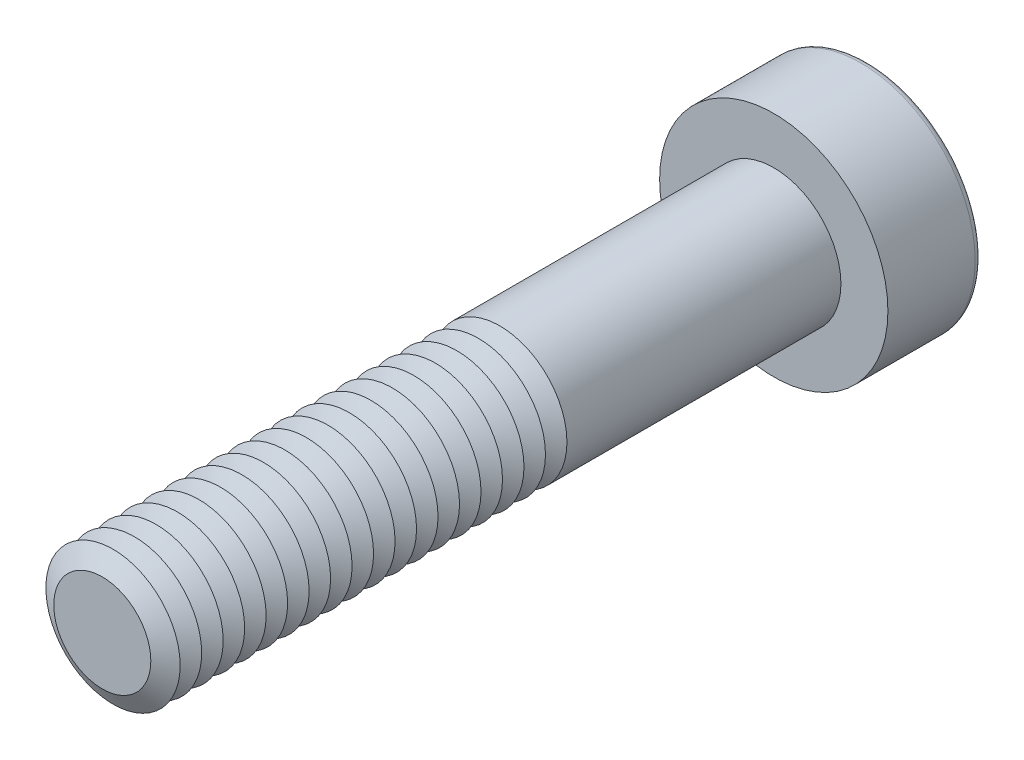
ISO-10303-21;
HEADER;
FILE_DESCRIPTION(('STEP AP214'),'2;1');
FILE_NAME('part.step','',(''),(''),'','','');
FILE_SCHEMA(('AUTOMOTIVE_DESIGN { 1 0 10303 214 1 1 1 1 }'));
ENDSEC;
DATA;
#1=APPLICATION_CONTEXT('core data for automotive mechanical design processes');
#2=APPLICATION_PROTOCOL_DEFINITION('international standard','automotive_design',2000,#1);
#3=PRODUCT_CONTEXT('',#1,'mechanical');
#4=PRODUCT('Part','Part','',(#3));
#5=PRODUCT_RELATED_PRODUCT_CATEGORY('part','',(#4));
#6=PRODUCT_DEFINITION_FORMATION('','',#4);
#7=PRODUCT_DEFINITION_CONTEXT('part definition',#1,'design');
#8=PRODUCT_DEFINITION('design','',#6,#7);
#9=PRODUCT_DEFINITION_SHAPE('','',#8);
#10=(LENGTH_UNIT() NAMED_UNIT(*) SI_UNIT(.MILLI.,.METRE.));
#11=(NAMED_UNIT(*) PLANE_ANGLE_UNIT() SI_UNIT($,.RADIAN.));
#12=(NAMED_UNIT(*) SI_UNIT($,.STERADIAN.) SOLID_ANGLE_UNIT());
#13=UNCERTAINTY_MEASURE_WITH_UNIT(LENGTH_MEASURE(1.E-05),#10,'distance_accuracy_value','');
#14=(GEOMETRIC_REPRESENTATION_CONTEXT(3) GLOBAL_UNCERTAINTY_ASSIGNED_CONTEXT((#13)) GLOBAL_UNIT_ASSIGNED_CONTEXT((#10,
#11,#12)) REPRESENTATION_CONTEXT('',''));
#15=CARTESIAN_POINT('',(0.,0.,0.));
#16=DIRECTION('',(0.,0.,1.));
#17=DIRECTION('',(1.,0.,0.));
#18=AXIS2_PLACEMENT_3D('',#15,#16,#17);
#19=CARTESIAN_POINT('',(0.,0.,22.2));
#20=DIRECTION('',(0.,0.,1.));
#21=DIRECTION('',(1.,0.,0.));
#22=AXIS2_PLACEMENT_3D('',#19,#20,#21);
#23=CONICAL_SURFACE('',#22,2.5,1.0471975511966);
#24=CARTESIAN_POINT('',(0.,0.,21.8));
#25=DIRECTION('',(0.,0.,1.));
#26=DIRECTION('',(1.,0.,0.));
#27=AXIS2_PLACEMENT_3D('',#24,#25,#26);
#28=CIRCLE('',#27,1.80717967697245);
#29=CARTESIAN_POINT('',(1.80717967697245,0.,21.8));
#30=VERTEX_POINT('',#29);
#31=EDGE_CURVE('E311',#30,#30,#28,.T.);
#32=ORIENTED_EDGE('',*,*,#31,.T.);
#33=EDGE_LOOP('',(#32));
#34=FACE_BOUND('',#33,.T.);
#35=CARTESIAN_POINT('',(0.,0.,22.2));
#36=DIRECTION('',(0.,0.,1.));
#37=DIRECTION('',(1.,0.,0.));
#38=AXIS2_PLACEMENT_3D('',#35,#36,#37);
#39=CIRCLE('',#38,2.5);
#40=CARTESIAN_POINT('',(2.5,0.,22.2));
#41=VERTEX_POINT('',#40);
#42=EDGE_CURVE('E314',#41,#41,#39,.T.);
#43=ORIENTED_EDGE('',*,*,#42,.F.);
#44=EDGE_LOOP('',(#43));
#45=FACE_BOUND('',#44,.T.);
#46=ADVANCED_FACE('F39',(#34,#45),#23,.T.);
#47=CARTESIAN_POINT('',(0.,0.,21.8));
#48=DIRECTION('',(0.,0.,-1.));
#49=DIRECTION('',(-1.,0.,0.));
#50=AXIS2_PLACEMENT_3D('',#47,#48,#49);
#51=CONICAL_SURFACE('',#50,1.80717967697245,1.0471975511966);
#52=CARTESIAN_POINT('',(0.,0.,21.4));
#53=DIRECTION('',(0.,0.,1.));
#54=DIRECTION('',(1.,0.,0.));
#55=AXIS2_PLACEMENT_3D('',#52,#53,#54);
#56=CIRCLE('',#55,2.5);
#57=CARTESIAN_POINT('',(2.5,0.,21.4));
#58=VERTEX_POINT('',#57);
#59=EDGE_CURVE('E322',#58,#58,#56,.T.);
#60=ORIENTED_EDGE('',*,*,#59,.T.);
#61=EDGE_LOOP('',(#60));
#62=FACE_BOUND('',#61,.T.);
#63=ORIENTED_EDGE('',*,*,#31,.F.);
#64=EDGE_LOOP('',(#63));
#65=FACE_BOUND('',#64,.T.);
#66=ADVANCED_FACE('F243',(#62,#65),#51,.T.);
#67=CARTESIAN_POINT('',(0.,0.,25.));
#68=DIRECTION('',(0.,0.,1.));
#69=DIRECTION('',(1.,0.,0.));
#70=AXIS2_PLACEMENT_3D('',#67,#68,#69);
#71=PLANE('',#70);
#72=CARTESIAN_POINT('',(0.,0.,25.));
#73=DIRECTION('',(0.,0.,1.));
#74=DIRECTION('',(1.,0.,0.));
#75=AXIS2_PLACEMENT_3D('',#72,#73,#74);
#76=CIRCLE('',#75,1.80717967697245);
#77=CARTESIAN_POINT('',(1.80717967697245,0.,25.));
#78=VERTEX_POINT('',#77);
#79=EDGE_CURVE('E172',#78,#78,#76,.T.);
#80=ORIENTED_EDGE('',*,*,#79,.T.);
#81=EDGE_LOOP('',(#80));
#82=FACE_BOUND('',#81,.T.);
#83=ADVANCED_FACE('F249',(#82),#71,.T.);
#84=CARTESIAN_POINT('',(0.,0.,25.));
#85=DIRECTION('',(0.,0.,-1.));
#86=DIRECTION('',(-1.,0.,0.));
#87=AXIS2_PLACEMENT_3D('',#84,#85,#86);
#88=CONICAL_SURFACE('',#87,1.80717967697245,1.0471975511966);
#89=CARTESIAN_POINT('',(0.,0.,24.6));
#90=DIRECTION('',(0.,0.,1.));
#91=DIRECTION('',(1.,0.,0.));
#92=AXIS2_PLACEMENT_3D('',#89,#90,#91);
#93=CIRCLE('',#92,2.5);
#94=CARTESIAN_POINT('',(2.5,0.,24.6));
#95=VERTEX_POINT('',#94);
#96=EDGE_CURVE('E289',#95,#95,#93,.T.);
#97=ORIENTED_EDGE('',*,*,#96,.T.);
#98=EDGE_LOOP('',(#97));
#99=FACE_BOUND('',#98,.T.);
#100=ORIENTED_EDGE('',*,*,#79,.F.);
#101=EDGE_LOOP('',(#100));
#102=FACE_BOUND('',#101,.T.);
#103=ADVANCED_FACE('F197',(#99,#102),#88,.T.);
#104=CARTESIAN_POINT('',(0.,0.,24.6));
#105=DIRECTION('',(0.,0.,1.));
#106=DIRECTION('',(1.,0.,0.));
#107=AXIS2_PLACEMENT_3D('',#104,#105,#106);
#108=CONICAL_SURFACE('',#107,2.5,1.0471975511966);
#109=CARTESIAN_POINT('',(0.,0.,24.2));
#110=DIRECTION('',(0.,0.,1.));
#111=DIRECTION('',(1.,0.,0.));
#112=AXIS2_PLACEMENT_3D('',#109,#110,#111);
#113=CIRCLE('',#112,1.80717967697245);
#114=CARTESIAN_POINT('',(1.80717967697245,0.,24.2));
#115=VERTEX_POINT('',#114);
#116=EDGE_CURVE('E286',#115,#115,#113,.T.);
#117=ORIENTED_EDGE('',*,*,#116,.T.);
#118=EDGE_LOOP('',(#117));
#119=FACE_BOUND('',#118,.T.);
#120=ORIENTED_EDGE('',*,*,#96,.F.);
#121=EDGE_LOOP('',(#120));
#122=FACE_BOUND('',#121,.T.);
#123=ADVANCED_FACE('F275',(#119,#122),#108,.T.);
#124=CARTESIAN_POINT('',(0.,0.,24.2));
#125=DIRECTION('',(0.,0.,-1.));
#126=DIRECTION('',(-1.,0.,0.));
#127=AXIS2_PLACEMENT_3D('',#124,#125,#126);
#128=CONICAL_SURFACE('',#127,1.80717967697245,1.0471975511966);
#129=CARTESIAN_POINT('',(0.,0.,23.8));
#130=DIRECTION('',(0.,0.,1.));
#131=DIRECTION('',(1.,0.,0.));
#132=AXIS2_PLACEMENT_3D('',#129,#130,#131);
#133=CIRCLE('',#132,2.5);
#134=CARTESIAN_POINT('',(2.5,0.,23.8));
#135=VERTEX_POINT('',#134);
#136=EDGE_CURVE('E297',#135,#135,#133,.T.);
#137=ORIENTED_EDGE('',*,*,#136,.T.);
#138=EDGE_LOOP('',(#137));
#139=FACE_BOUND('',#138,.T.);
#140=ORIENTED_EDGE('',*,*,#116,.F.);
#141=EDGE_LOOP('',(#140));
#142=FACE_BOUND('',#141,.T.);
#143=ADVANCED_FACE('F272',(#139,#142),#128,.T.);
#144=CARTESIAN_POINT('',(0.,0.,23.8));
#145=DIRECTION('',(0.,0.,1.));
#146=DIRECTION('',(1.,0.,0.));
#147=AXIS2_PLACEMENT_3D('',#144,#145,#146);
#148=CONICAL_SURFACE('',#147,2.5,1.0471975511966);
#149=CARTESIAN_POINT('',(0.,0.,23.4));
#150=DIRECTION('',(0.,0.,1.));
#151=DIRECTION('',(1.,0.,0.));
#152=AXIS2_PLACEMENT_3D('',#149,#150,#151);
#153=CIRCLE('',#152,1.80717967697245);
#154=CARTESIAN_POINT('',(1.80717967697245,0.,23.4));
#155=VERTEX_POINT('',#154);
#156=EDGE_CURVE('E291',#155,#155,#153,.T.);
#157=ORIENTED_EDGE('',*,*,#156,.T.);
#158=EDGE_LOOP('',(#157));
#159=FACE_BOUND('',#158,.T.);
#160=ORIENTED_EDGE('',*,*,#136,.F.);
#161=EDGE_LOOP('',(#160));
#162=FACE_BOUND('',#161,.T.);
#163=ADVANCED_FACE('F268',(#159,#162),#148,.T.);
#164=CARTESIAN_POINT('',(0.,0.,23.4));
#165=DIRECTION('',(0.,0.,-1.));
#166=DIRECTION('',(-1.,0.,0.));
#167=AXIS2_PLACEMENT_3D('',#164,#165,#166);
#168=CONICAL_SURFACE('',#167,1.80717967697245,1.0471975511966);
#169=CARTESIAN_POINT('',(0.,0.,23.));
#170=DIRECTION('',(0.,0.,1.));
#171=DIRECTION('',(1.,0.,0.));
#172=AXIS2_PLACEMENT_3D('',#169,#170,#171);
#173=CIRCLE('',#172,2.5);
#174=CARTESIAN_POINT('',(2.5,0.,23.));
#175=VERTEX_POINT('',#174);
#176=EDGE_CURVE('E307',#175,#175,#173,.T.);
#177=ORIENTED_EDGE('',*,*,#176,.T.);
#178=EDGE_LOOP('',(#177));
#179=FACE_BOUND('',#178,.T.);
#180=ORIENTED_EDGE('',*,*,#156,.F.);
#181=EDGE_LOOP('',(#180));
#182=FACE_BOUND('',#181,.T.);
#183=ADVANCED_FACE('F264',(#179,#182),#168,.T.);
#184=CARTESIAN_POINT('',(0.,0.,23.));
#185=DIRECTION('',(0.,0.,1.));
#186=DIRECTION('',(1.,0.,0.));
#187=AXIS2_PLACEMENT_3D('',#184,#185,#186);
#188=CONICAL_SURFACE('',#187,2.5,1.0471975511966);
#189=CARTESIAN_POINT('',(0.,0.,22.6));
#190=DIRECTION('',(0.,0.,1.));
#191=DIRECTION('',(1.,0.,0.));
#192=AXIS2_PLACEMENT_3D('',#189,#190,#191);
#193=CIRCLE('',#192,1.80717967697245);
#194=CARTESIAN_POINT('',(1.80717967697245,0.,22.6));
#195=VERTEX_POINT('',#194);
#196=EDGE_CURVE('E303',#195,#195,#193,.T.);
#197=ORIENTED_EDGE('',*,*,#196,.T.);
#198=EDGE_LOOP('',(#197));
#199=FACE_BOUND('',#198,.T.);
#200=ORIENTED_EDGE('',*,*,#176,.F.);
#201=EDGE_LOOP('',(#200));
#202=FACE_BOUND('',#201,.T.);
#203=ADVANCED_FACE('F260',(#199,#202),#188,.T.);
#204=CARTESIAN_POINT('',(0.,0.,22.6));
#205=DIRECTION('',(0.,0.,-1.));
#206=DIRECTION('',(-1.,0.,0.));
#207=AXIS2_PLACEMENT_3D('',#204,#205,#206);
#208=CONICAL_SURFACE('',#207,1.80717967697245,1.0471975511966);
#209=ORIENTED_EDGE('',*,*,#42,.T.);
#210=EDGE_LOOP('',(#209));
#211=FACE_BOUND('',#210,.T.);
#212=ORIENTED_EDGE('',*,*,#196,.F.);
#213=EDGE_LOOP('',(#212));
#214=FACE_BOUND('',#213,.T.);
#215=ADVANCED_FACE('F256',(#211,#214),#208,.T.);
#216=CARTESIAN_POINT('',(0.,0.,21.4));
#217=DIRECTION('',(0.,0.,1.));
#218=DIRECTION('',(1.,0.,0.));
#219=AXIS2_PLACEMENT_3D('',#216,#217,#218);
#220=CONICAL_SURFACE('',#219,2.5,1.0471975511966);
#221=CARTESIAN_POINT('',(0.,0.,21.));
#222=DIRECTION('',(0.,0.,1.));
#223=DIRECTION('',(1.,0.,0.));
#224=AXIS2_PLACEMENT_3D('',#221,#222,#223);
#225=CIRCLE('',#224,1.80717967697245);
#226=CARTESIAN_POINT('',(1.80717967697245,0.,21.));
#227=VERTEX_POINT('',#226);
#228=EDGE_CURVE('E318',#227,#227,#225,.T.);
#229=ORIENTED_EDGE('',*,*,#228,.T.);
#230=EDGE_LOOP('',(#229));
#231=FACE_BOUND('',#230,.T.);
#232=ORIENTED_EDGE('',*,*,#59,.F.);
#233=EDGE_LOOP('',(#232));
#234=FACE_BOUND('',#233,.T.);
#235=ADVANCED_FACE('F259',(#231,#234),#220,.T.);
#236=CARTESIAN_POINT('',(0.,0.,21.));
#237=DIRECTION('',(0.,0.,-1.));
#238=DIRECTION('',(-1.,0.,0.));
#239=AXIS2_PLACEMENT_3D('',#236,#237,#238);
#240=CONICAL_SURFACE('',#239,1.80717967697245,1.0471975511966);
#241=CARTESIAN_POINT('',(0.,0.,20.6));
#242=DIRECTION('',(0.,0.,1.));
#243=DIRECTION('',(1.,0.,0.));
#244=AXIS2_PLACEMENT_3D('',#241,#242,#243);
#245=CIRCLE('',#244,2.5);
#246=CARTESIAN_POINT('',(2.5,0.,20.6));
#247=VERTEX_POINT('',#246);
#248=EDGE_CURVE('E330',#247,#247,#245,.T.);
#249=ORIENTED_EDGE('',*,*,#248,.T.);
#250=EDGE_LOOP('',(#249));
#251=FACE_BOUND('',#250,.T.);
#252=ORIENTED_EDGE('',*,*,#228,.F.);
#253=EDGE_LOOP('',(#252));
#254=FACE_BOUND('',#253,.T.);
#255=ADVANCED_FACE('F543',(#251,#254),#240,.T.);
#256=CARTESIAN_POINT('',(0.,0.,20.6));
#257=DIRECTION('',(0.,0.,1.));
#258=DIRECTION('',(1.,0.,0.));
#259=AXIS2_PLACEMENT_3D('',#256,#257,#258);
#260=CONICAL_SURFACE('',#259,2.5,1.0471975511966);
#261=CARTESIAN_POINT('',(0.,0.,20.2));
#262=DIRECTION('',(0.,0.,1.));
#263=DIRECTION('',(1.,0.,0.));
#264=AXIS2_PLACEMENT_3D('',#261,#262,#263);
#265=CIRCLE('',#264,1.80717967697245);
#266=CARTESIAN_POINT('',(1.80717967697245,0.,20.2));
#267=VERTEX_POINT('',#266);
#268=EDGE_CURVE('E326',#267,#267,#265,.T.);
#269=ORIENTED_EDGE('',*,*,#268,.T.);
#270=EDGE_LOOP('',(#269));
#271=FACE_BOUND('',#270,.T.);
#272=ORIENTED_EDGE('',*,*,#248,.F.);
#273=EDGE_LOOP('',(#272));
#274=FACE_BOUND('',#273,.T.);
#275=ADVANCED_FACE('F539',(#271,#274),#260,.T.);
#276=CARTESIAN_POINT('',(0.,0.,20.2));
#277=DIRECTION('',(0.,0.,-1.));
#278=DIRECTION('',(-1.,0.,0.));
#279=AXIS2_PLACEMENT_3D('',#276,#277,#278);
#280=CONICAL_SURFACE('',#279,1.80717967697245,1.0471975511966);
#281=CARTESIAN_POINT('',(0.,0.,19.8));
#282=DIRECTION('',(0.,0.,1.));
#283=DIRECTION('',(1.,0.,0.));
#284=AXIS2_PLACEMENT_3D('',#281,#282,#283);
#285=CIRCLE('',#284,2.5);
#286=CARTESIAN_POINT('',(2.5,0.,19.8));
#287=VERTEX_POINT('',#286);
#288=EDGE_CURVE('E338',#287,#287,#285,.T.);
#289=ORIENTED_EDGE('',*,*,#288,.T.);
#290=EDGE_LOOP('',(#289));
#291=FACE_BOUND('',#290,.T.);
#292=ORIENTED_EDGE('',*,*,#268,.F.);
#293=EDGE_LOOP('',(#292));
#294=FACE_BOUND('',#293,.T.);
#295=ADVANCED_FACE('F535',(#291,#294),#280,.T.);
#296=CARTESIAN_POINT('',(0.,0.,19.8));
#297=DIRECTION('',(0.,0.,1.));
#298=DIRECTION('',(1.,0.,0.));
#299=AXIS2_PLACEMENT_3D('',#296,#297,#298);
#300=CONICAL_SURFACE('',#299,2.5,1.0471975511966);
#301=CARTESIAN_POINT('',(0.,0.,19.4));
#302=DIRECTION('',(0.,0.,1.));
#303=DIRECTION('',(1.,0.,0.));
#304=AXIS2_PLACEMENT_3D('',#301,#302,#303);
#305=CIRCLE('',#304,1.80717967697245);
#306=CARTESIAN_POINT('',(1.80717967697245,0.,19.4));
#307=VERTEX_POINT('',#306);
#308=EDGE_CURVE('E334',#307,#307,#305,.T.);
#309=ORIENTED_EDGE('',*,*,#308,.T.);
#310=EDGE_LOOP('',(#309));
#311=FACE_BOUND('',#310,.T.);
#312=ORIENTED_EDGE('',*,*,#288,.F.);
#313=EDGE_LOOP('',(#312));
#314=FACE_BOUND('',#313,.T.);
#315=ADVANCED_FACE('F531',(#311,#314),#300,.T.);
#316=CARTESIAN_POINT('',(0.,0.,19.4));
#317=DIRECTION('',(0.,0.,-1.));
#318=DIRECTION('',(-1.,0.,0.));
#319=AXIS2_PLACEMENT_3D('',#316,#317,#318);
#320=CONICAL_SURFACE('',#319,1.80717967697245,1.0471975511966);
#321=CARTESIAN_POINT('',(0.,0.,19.));
#322=DIRECTION('',(0.,0.,1.));
#323=DIRECTION('',(1.,0.,0.));
#324=AXIS2_PLACEMENT_3D('',#321,#322,#323);
#325=CIRCLE('',#324,2.5);
#326=CARTESIAN_POINT('',(2.5,0.,19.));
#327=VERTEX_POINT('',#326);
#328=EDGE_CURVE('E346',#327,#327,#325,.T.);
#329=ORIENTED_EDGE('',*,*,#328,.T.);
#330=EDGE_LOOP('',(#329));
#331=FACE_BOUND('',#330,.T.);
#332=ORIENTED_EDGE('',*,*,#308,.F.);
#333=EDGE_LOOP('',(#332));
#334=FACE_BOUND('',#333,.T.);
#335=ADVANCED_FACE('F527',(#331,#334),#320,.T.);
#336=CARTESIAN_POINT('',(0.,0.,19.));
#337=DIRECTION('',(0.,0.,1.));
#338=DIRECTION('',(1.,0.,0.));
#339=AXIS2_PLACEMENT_3D('',#336,#337,#338);
#340=CONICAL_SURFACE('',#339,2.5,1.0471975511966);
#341=CARTESIAN_POINT('',(0.,0.,18.6));
#342=DIRECTION('',(0.,0.,1.));
#343=DIRECTION('',(1.,0.,0.));
#344=AXIS2_PLACEMENT_3D('',#341,#342,#343);
#345=CIRCLE('',#344,1.80717967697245);
#346=CARTESIAN_POINT('',(1.80717967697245,0.,18.6));
#347=VERTEX_POINT('',#346);
#348=EDGE_CURVE('E342',#347,#347,#345,.T.);
#349=ORIENTED_EDGE('',*,*,#348,.T.);
#350=EDGE_LOOP('',(#349));
#351=FACE_BOUND('',#350,.T.);
#352=ORIENTED_EDGE('',*,*,#328,.F.);
#353=EDGE_LOOP('',(#352));
#354=FACE_BOUND('',#353,.T.);
#355=ADVANCED_FACE('F523',(#351,#354),#340,.T.);
#356=CARTESIAN_POINT('',(0.,0.,18.6));
#357=DIRECTION('',(0.,0.,-1.));
#358=DIRECTION('',(-1.,0.,0.));
#359=AXIS2_PLACEMENT_3D('',#356,#357,#358);
#360=CONICAL_SURFACE('',#359,1.80717967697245,1.0471975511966);
#361=CARTESIAN_POINT('',(0.,0.,18.2));
#362=DIRECTION('',(0.,0.,1.));
#363=DIRECTION('',(1.,0.,0.));
#364=AXIS2_PLACEMENT_3D('',#361,#362,#363);
#365=CIRCLE('',#364,2.5);
#366=CARTESIAN_POINT('',(2.5,0.,18.2));
#367=VERTEX_POINT('',#366);
#368=EDGE_CURVE('E354',#367,#367,#365,.T.);
#369=ORIENTED_EDGE('',*,*,#368,.T.);
#370=EDGE_LOOP('',(#369));
#371=FACE_BOUND('',#370,.T.);
#372=ORIENTED_EDGE('',*,*,#348,.F.);
#373=EDGE_LOOP('',(#372));
#374=FACE_BOUND('',#373,.T.);
#375=ADVANCED_FACE('F519',(#371,#374),#360,.T.);
#376=CARTESIAN_POINT('',(0.,0.,18.2));
#377=DIRECTION('',(0.,0.,1.));
#378=DIRECTION('',(1.,0.,0.));
#379=AXIS2_PLACEMENT_3D('',#376,#377,#378);
#380=CONICAL_SURFACE('',#379,2.5,1.0471975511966);
#381=CARTESIAN_POINT('',(0.,0.,17.8));
#382=DIRECTION('',(0.,0.,1.));
#383=DIRECTION('',(1.,0.,0.));
#384=AXIS2_PLACEMENT_3D('',#381,#382,#383);
#385=CIRCLE('',#384,1.80717967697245);
#386=CARTESIAN_POINT('',(1.80717967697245,0.,17.8));
#387=VERTEX_POINT('',#386);
#388=EDGE_CURVE('E350',#387,#387,#385,.T.);
#389=ORIENTED_EDGE('',*,*,#388,.T.);
#390=EDGE_LOOP('',(#389));
#391=FACE_BOUND('',#390,.T.);
#392=ORIENTED_EDGE('',*,*,#368,.F.);
#393=EDGE_LOOP('',(#392));
#394=FACE_BOUND('',#393,.T.);
#395=ADVANCED_FACE('F515',(#391,#394),#380,.T.);
#396=CARTESIAN_POINT('',(0.,0.,17.8));
#397=DIRECTION('',(0.,0.,-1.));
#398=DIRECTION('',(-1.,0.,0.));
#399=AXIS2_PLACEMENT_3D('',#396,#397,#398);
#400=CONICAL_SURFACE('',#399,1.80717967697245,1.0471975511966);
#401=CARTESIAN_POINT('',(0.,0.,17.4));
#402=DIRECTION('',(0.,0.,1.));
#403=DIRECTION('',(1.,0.,0.));
#404=AXIS2_PLACEMENT_3D('',#401,#402,#403);
#405=CIRCLE('',#404,2.5);
#406=CARTESIAN_POINT('',(2.5,0.,17.4));
#407=VERTEX_POINT('',#406);
#408=EDGE_CURVE('E362',#407,#407,#405,.T.);
#409=ORIENTED_EDGE('',*,*,#408,.T.);
#410=EDGE_LOOP('',(#409));
#411=FACE_BOUND('',#410,.T.);
#412=ORIENTED_EDGE('',*,*,#388,.F.);
#413=EDGE_LOOP('',(#412));
#414=FACE_BOUND('',#413,.T.);
#415=ADVANCED_FACE('F511',(#411,#414),#400,.T.);
#416=CARTESIAN_POINT('',(0.,0.,17.4));
#417=DIRECTION('',(0.,0.,1.));
#418=DIRECTION('',(1.,0.,0.));
#419=AXIS2_PLACEMENT_3D('',#416,#417,#418);
#420=CONICAL_SURFACE('',#419,2.5,1.0471975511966);
#421=CARTESIAN_POINT('',(0.,0.,17.));
#422=DIRECTION('',(0.,0.,1.));
#423=DIRECTION('',(1.,0.,0.));
#424=AXIS2_PLACEMENT_3D('',#421,#422,#423);
#425=CIRCLE('',#424,1.80717967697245);
#426=CARTESIAN_POINT('',(1.80717967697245,0.,17.));
#427=VERTEX_POINT('',#426);
#428=EDGE_CURVE('E358',#427,#427,#425,.T.);
#429=ORIENTED_EDGE('',*,*,#428,.T.);
#430=EDGE_LOOP('',(#429));
#431=FACE_BOUND('',#430,.T.);
#432=ORIENTED_EDGE('',*,*,#408,.F.);
#433=EDGE_LOOP('',(#432));
#434=FACE_BOUND('',#433,.T.);
#435=ADVANCED_FACE('F507',(#431,#434),#420,.T.);
#436=CARTESIAN_POINT('',(0.,0.,17.));
#437=DIRECTION('',(0.,0.,-1.));
#438=DIRECTION('',(-1.,0.,0.));
#439=AXIS2_PLACEMENT_3D('',#436,#437,#438);
#440=CONICAL_SURFACE('',#439,1.80717967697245,1.0471975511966);
#441=CARTESIAN_POINT('',(0.,0.,16.6));
#442=DIRECTION('',(0.,0.,1.));
#443=DIRECTION('',(1.,0.,0.));
#444=AXIS2_PLACEMENT_3D('',#441,#442,#443);
#445=CIRCLE('',#444,2.5);
#446=CARTESIAN_POINT('',(2.5,0.,16.6));
#447=VERTEX_POINT('',#446);
#448=EDGE_CURVE('E370',#447,#447,#445,.T.);
#449=ORIENTED_EDGE('',*,*,#448,.T.);
#450=EDGE_LOOP('',(#449));
#451=FACE_BOUND('',#450,.T.);
#452=ORIENTED_EDGE('',*,*,#428,.F.);
#453=EDGE_LOOP('',(#452));
#454=FACE_BOUND('',#453,.T.);
#455=ADVANCED_FACE('F503',(#451,#454),#440,.T.);
#456=CARTESIAN_POINT('',(0.,0.,16.6));
#457=DIRECTION('',(0.,0.,1.));
#458=DIRECTION('',(1.,0.,0.));
#459=AXIS2_PLACEMENT_3D('',#456,#457,#458);
#460=CONICAL_SURFACE('',#459,2.5,1.0471975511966);
#461=CARTESIAN_POINT('',(0.,0.,16.2));
#462=DIRECTION('',(0.,0.,1.));
#463=DIRECTION('',(1.,0.,0.));
#464=AXIS2_PLACEMENT_3D('',#461,#462,#463);
#465=CIRCLE('',#464,1.80717967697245);
#466=CARTESIAN_POINT('',(1.80717967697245,0.,16.2));
#467=VERTEX_POINT('',#466);
#468=EDGE_CURVE('E366',#467,#467,#465,.T.);
#469=ORIENTED_EDGE('',*,*,#468,.T.);
#470=EDGE_LOOP('',(#469));
#471=FACE_BOUND('',#470,.T.);
#472=ORIENTED_EDGE('',*,*,#448,.F.);
#473=EDGE_LOOP('',(#472));
#474=FACE_BOUND('',#473,.T.);
#475=ADVANCED_FACE('F499',(#471,#474),#460,.T.);
#476=CARTESIAN_POINT('',(0.,0.,16.2));
#477=DIRECTION('',(0.,0.,-1.));
#478=DIRECTION('',(-1.,0.,0.));
#479=AXIS2_PLACEMENT_3D('',#476,#477,#478);
#480=CONICAL_SURFACE('',#479,1.80717967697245,1.0471975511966);
#481=CARTESIAN_POINT('',(0.,0.,15.8));
#482=DIRECTION('',(0.,0.,1.));
#483=DIRECTION('',(1.,0.,0.));
#484=AXIS2_PLACEMENT_3D('',#481,#482,#483);
#485=CIRCLE('',#484,2.5);
#486=CARTESIAN_POINT('',(2.5,0.,15.8));
#487=VERTEX_POINT('',#486);
#488=EDGE_CURVE('E378',#487,#487,#485,.T.);
#489=ORIENTED_EDGE('',*,*,#488,.T.);
#490=EDGE_LOOP('',(#489));
#491=FACE_BOUND('',#490,.T.);
#492=ORIENTED_EDGE('',*,*,#468,.F.);
#493=EDGE_LOOP('',(#492));
#494=FACE_BOUND('',#493,.T.);
#495=ADVANCED_FACE('F495',(#491,#494),#480,.T.);
#496=CARTESIAN_POINT('',(0.,0.,15.8));
#497=DIRECTION('',(0.,0.,1.));
#498=DIRECTION('',(1.,0.,0.));
#499=AXIS2_PLACEMENT_3D('',#496,#497,#498);
#500=CONICAL_SURFACE('',#499,2.5,1.0471975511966);
#501=CARTESIAN_POINT('',(0.,0.,15.4));
#502=DIRECTION('',(0.,0.,1.));
#503=DIRECTION('',(1.,0.,0.));
#504=AXIS2_PLACEMENT_3D('',#501,#502,#503);
#505=CIRCLE('',#504,1.80717967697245);
#506=CARTESIAN_POINT('',(1.80717967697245,0.,15.4));
#507=VERTEX_POINT('',#506);
#508=EDGE_CURVE('E374',#507,#507,#505,.T.);
#509=ORIENTED_EDGE('',*,*,#508,.T.);
#510=EDGE_LOOP('',(#509));
#511=FACE_BOUND('',#510,.T.);
#512=ORIENTED_EDGE('',*,*,#488,.F.);
#513=EDGE_LOOP('',(#512));
#514=FACE_BOUND('',#513,.T.);
#515=ADVANCED_FACE('F491',(#511,#514),#500,.T.);
#516=CARTESIAN_POINT('',(0.,0.,15.4));
#517=DIRECTION('',(0.,0.,-1.));
#518=DIRECTION('',(-1.,0.,0.));
#519=AXIS2_PLACEMENT_3D('',#516,#517,#518);
#520=CONICAL_SURFACE('',#519,1.80717967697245,1.0471975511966);
#521=CARTESIAN_POINT('',(0.,0.,15.));
#522=DIRECTION('',(0.,0.,1.));
#523=DIRECTION('',(1.,0.,0.));
#524=AXIS2_PLACEMENT_3D('',#521,#522,#523);
#525=CIRCLE('',#524,2.5);
#526=CARTESIAN_POINT('',(2.5,0.,15.));
#527=VERTEX_POINT('',#526);
#528=EDGE_CURVE('E386',#527,#527,#525,.T.);
#529=ORIENTED_EDGE('',*,*,#528,.T.);
#530=EDGE_LOOP('',(#529));
#531=FACE_BOUND('',#530,.T.);
#532=ORIENTED_EDGE('',*,*,#508,.F.);
#533=EDGE_LOOP('',(#532));
#534=FACE_BOUND('',#533,.T.);
#535=ADVANCED_FACE('F487',(#531,#534),#520,.T.);
#536=CARTESIAN_POINT('',(0.,0.,15.));
#537=DIRECTION('',(0.,0.,1.));
#538=DIRECTION('',(1.,0.,0.));
#539=AXIS2_PLACEMENT_3D('',#536,#537,#538);
#540=CONICAL_SURFACE('',#539,2.5,1.0471975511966);
#541=CARTESIAN_POINT('',(0.,0.,14.6));
#542=DIRECTION('',(0.,0.,1.));
#543=DIRECTION('',(1.,0.,0.));
#544=AXIS2_PLACEMENT_3D('',#541,#542,#543);
#545=CIRCLE('',#544,1.80717967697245);
#546=CARTESIAN_POINT('',(1.80717967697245,0.,14.6));
#547=VERTEX_POINT('',#546);
#548=EDGE_CURVE('E382',#547,#547,#545,.T.);
#549=ORIENTED_EDGE('',*,*,#548,.T.);
#550=EDGE_LOOP('',(#549));
#551=FACE_BOUND('',#550,.T.);
#552=ORIENTED_EDGE('',*,*,#528,.F.);
#553=EDGE_LOOP('',(#552));
#554=FACE_BOUND('',#553,.T.);
#555=ADVANCED_FACE('F483',(#551,#554),#540,.T.);
#556=CARTESIAN_POINT('',(0.,0.,14.6));
#557=DIRECTION('',(0.,0.,-1.));
#558=DIRECTION('',(-1.,0.,0.));
#559=AXIS2_PLACEMENT_3D('',#556,#557,#558);
#560=CONICAL_SURFACE('',#559,1.80717967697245,1.0471975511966);
#561=CARTESIAN_POINT('',(0.,0.,14.2));
#562=DIRECTION('',(0.,0.,1.));
#563=DIRECTION('',(1.,0.,0.));
#564=AXIS2_PLACEMENT_3D('',#561,#562,#563);
#565=CIRCLE('',#564,2.5);
#566=CARTESIAN_POINT('',(2.5,0.,14.2));
#567=VERTEX_POINT('',#566);
#568=EDGE_CURVE('E394',#567,#567,#565,.T.);
#569=ORIENTED_EDGE('',*,*,#568,.T.);
#570=EDGE_LOOP('',(#569));
#571=FACE_BOUND('',#570,.T.);
#572=ORIENTED_EDGE('',*,*,#548,.F.);
#573=EDGE_LOOP('',(#572));
#574=FACE_BOUND('',#573,.T.);
#575=ADVANCED_FACE('F479',(#571,#574),#560,.T.);
#576=CARTESIAN_POINT('',(0.,0.,14.2));
#577=DIRECTION('',(0.,0.,1.));
#578=DIRECTION('',(1.,0.,0.));
#579=AXIS2_PLACEMENT_3D('',#576,#577,#578);
#580=CONICAL_SURFACE('',#579,2.5,1.0471975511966);
#581=CARTESIAN_POINT('',(0.,0.,13.8));
#582=DIRECTION('',(0.,0.,1.));
#583=DIRECTION('',(1.,0.,0.));
#584=AXIS2_PLACEMENT_3D('',#581,#582,#583);
#585=CIRCLE('',#584,1.80717967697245);
#586=CARTESIAN_POINT('',(1.80717967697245,0.,13.8));
#587=VERTEX_POINT('',#586);
#588=EDGE_CURVE('E390',#587,#587,#585,.T.);
#589=ORIENTED_EDGE('',*,*,#588,.T.);
#590=EDGE_LOOP('',(#589));
#591=FACE_BOUND('',#590,.T.);
#592=ORIENTED_EDGE('',*,*,#568,.F.);
#593=EDGE_LOOP('',(#592));
#594=FACE_BOUND('',#593,.T.);
#595=ADVANCED_FACE('F475',(#591,#594),#580,.T.);
#596=CARTESIAN_POINT('',(0.,0.,13.8));
#597=DIRECTION('',(0.,0.,-1.));
#598=DIRECTION('',(-1.,0.,0.));
#599=AXIS2_PLACEMENT_3D('',#596,#597,#598);
#600=CONICAL_SURFACE('',#599,1.80717967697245,1.0471975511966);
#601=CARTESIAN_POINT('',(0.,0.,13.4));
#602=DIRECTION('',(0.,0.,1.));
#603=DIRECTION('',(1.,0.,0.));
#604=AXIS2_PLACEMENT_3D('',#601,#602,#603);
#605=CIRCLE('',#604,2.5);
#606=CARTESIAN_POINT('',(2.5,0.,13.4));
#607=VERTEX_POINT('',#606);
#608=EDGE_CURVE('E402',#607,#607,#605,.T.);
#609=ORIENTED_EDGE('',*,*,#608,.T.);
#610=EDGE_LOOP('',(#609));
#611=FACE_BOUND('',#610,.T.);
#612=ORIENTED_EDGE('',*,*,#588,.F.);
#613=EDGE_LOOP('',(#612));
#614=FACE_BOUND('',#613,.T.);
#615=ADVANCED_FACE('F471',(#611,#614),#600,.T.);
#616=CARTESIAN_POINT('',(0.,0.,13.4));
#617=DIRECTION('',(0.,0.,1.));
#618=DIRECTION('',(1.,0.,0.));
#619=AXIS2_PLACEMENT_3D('',#616,#617,#618);
#620=CONICAL_SURFACE('',#619,2.5,1.0471975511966);
#621=CARTESIAN_POINT('',(0.,0.,13.));
#622=DIRECTION('',(0.,0.,1.));
#623=DIRECTION('',(1.,0.,0.));
#624=AXIS2_PLACEMENT_3D('',#621,#622,#623);
#625=CIRCLE('',#624,1.80717967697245);
#626=CARTESIAN_POINT('',(1.80717967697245,0.,13.));
#627=VERTEX_POINT('',#626);
#628=EDGE_CURVE('E398',#627,#627,#625,.T.);
#629=ORIENTED_EDGE('',*,*,#628,.T.);
#630=EDGE_LOOP('',(#629));
#631=FACE_BOUND('',#630,.T.);
#632=ORIENTED_EDGE('',*,*,#608,.F.);
#633=EDGE_LOOP('',(#632));
#634=FACE_BOUND('',#633,.T.);
#635=ADVANCED_FACE('F467',(#631,#634),#620,.T.);
#636=CARTESIAN_POINT('',(0.,0.,13.));
#637=DIRECTION('',(0.,0.,-1.));
#638=DIRECTION('',(-1.,0.,0.));
#639=AXIS2_PLACEMENT_3D('',#636,#637,#638);
#640=CONICAL_SURFACE('',#639,1.80717967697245,1.0471975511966);
#641=CARTESIAN_POINT('',(0.,0.,12.6));
#642=DIRECTION('',(0.,0.,1.));
#643=DIRECTION('',(1.,0.,0.));
#644=AXIS2_PLACEMENT_3D('',#641,#642,#643);
#645=CIRCLE('',#644,2.5);
#646=CARTESIAN_POINT('',(2.5,0.,12.6));
#647=VERTEX_POINT('',#646);
#648=EDGE_CURVE('E410',#647,#647,#645,.T.);
#649=ORIENTED_EDGE('',*,*,#648,.T.);
#650=EDGE_LOOP('',(#649));
#651=FACE_BOUND('',#650,.T.);
#652=ORIENTED_EDGE('',*,*,#628,.F.);
#653=EDGE_LOOP('',(#652));
#654=FACE_BOUND('',#653,.T.);
#655=ADVANCED_FACE('F463',(#651,#654),#640,.T.);
#656=CARTESIAN_POINT('',(0.,0.,12.6));
#657=DIRECTION('',(0.,0.,1.));
#658=DIRECTION('',(1.,0.,0.));
#659=AXIS2_PLACEMENT_3D('',#656,#657,#658);
#660=CONICAL_SURFACE('',#659,2.5,1.0471975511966);
#661=CARTESIAN_POINT('',(0.,0.,12.2));
#662=DIRECTION('',(0.,0.,1.));
#663=DIRECTION('',(1.,0.,0.));
#664=AXIS2_PLACEMENT_3D('',#661,#662,#663);
#665=CIRCLE('',#664,1.80717967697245);
#666=CARTESIAN_POINT('',(1.80717967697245,0.,12.2));
#667=VERTEX_POINT('',#666);
#668=EDGE_CURVE('E406',#667,#667,#665,.T.);
#669=ORIENTED_EDGE('',*,*,#668,.T.);
#670=EDGE_LOOP('',(#669));
#671=FACE_BOUND('',#670,.T.);
#672=ORIENTED_EDGE('',*,*,#648,.F.);
#673=EDGE_LOOP('',(#672));
#674=FACE_BOUND('',#673,.T.);
#675=ADVANCED_FACE('F459',(#671,#674),#660,.T.);
#676=CARTESIAN_POINT('',(0.,0.,12.2));
#677=DIRECTION('',(0.,0.,-1.));
#678=DIRECTION('',(-1.,0.,0.));
#679=AXIS2_PLACEMENT_3D('',#676,#677,#678);
#680=CONICAL_SURFACE('',#679,1.80717967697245,1.0471975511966);
#681=CARTESIAN_POINT('',(0.,0.,11.8));
#682=DIRECTION('',(0.,0.,1.));
#683=DIRECTION('',(1.,0.,0.));
#684=AXIS2_PLACEMENT_3D('',#681,#682,#683);
#685=CIRCLE('',#684,2.5);
#686=CARTESIAN_POINT('',(2.5,0.,11.8));
#687=VERTEX_POINT('',#686);
#688=EDGE_CURVE('E418',#687,#687,#685,.T.);
#689=ORIENTED_EDGE('',*,*,#688,.T.);
#690=EDGE_LOOP('',(#689));
#691=FACE_BOUND('',#690,.T.);
#692=ORIENTED_EDGE('',*,*,#668,.F.);
#693=EDGE_LOOP('',(#692));
#694=FACE_BOUND('',#693,.T.);
#695=ADVANCED_FACE('F455',(#691,#694),#680,.T.);
#696=CARTESIAN_POINT('',(0.,0.,11.8));
#697=DIRECTION('',(0.,0.,1.));
#698=DIRECTION('',(1.,0.,0.));
#699=AXIS2_PLACEMENT_3D('',#696,#697,#698);
#700=CONICAL_SURFACE('',#699,2.5,1.0471975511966);
#701=CARTESIAN_POINT('',(0.,0.,11.4));
#702=DIRECTION('',(0.,0.,1.));
#703=DIRECTION('',(1.,0.,0.));
#704=AXIS2_PLACEMENT_3D('',#701,#702,#703);
#705=CIRCLE('',#704,1.80717967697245);
#706=CARTESIAN_POINT('',(1.80717967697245,0.,11.4));
#707=VERTEX_POINT('',#706);
#708=EDGE_CURVE('E414',#707,#707,#705,.T.);
#709=ORIENTED_EDGE('',*,*,#708,.T.);
#710=EDGE_LOOP('',(#709));
#711=FACE_BOUND('',#710,.T.);
#712=ORIENTED_EDGE('',*,*,#688,.F.);
#713=EDGE_LOOP('',(#712));
#714=FACE_BOUND('',#713,.T.);
#715=ADVANCED_FACE('F450',(#711,#714),#700,.T.);
#716=CARTESIAN_POINT('',(0.,0.,11.4));
#717=DIRECTION('',(0.,0.,-1.));
#718=DIRECTION('',(-1.,0.,0.));
#719=AXIS2_PLACEMENT_3D('',#716,#717,#718);
#720=CONICAL_SURFACE('',#719,1.80717967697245,1.0471975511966);
#721=CARTESIAN_POINT('',(0.,0.,11.));
#722=DIRECTION('',(0.,0.,1.));
#723=DIRECTION('',(1.,0.,0.));
#724=AXIS2_PLACEMENT_3D('',#721,#722,#723);
#725=CIRCLE('',#724,2.5);
#726=CARTESIAN_POINT('',(2.5,0.,11.));
#727=VERTEX_POINT('',#726);
#728=EDGE_CURVE('E430',#727,#727,#725,.T.);
#729=ORIENTED_EDGE('',*,*,#728,.T.);
#730=EDGE_LOOP('',(#729));
#731=FACE_BOUND('',#730,.T.);
#732=ORIENTED_EDGE('',*,*,#708,.F.);
#733=EDGE_LOOP('',(#732));
#734=FACE_BOUND('',#733,.T.);
#735=ADVANCED_FACE('F436',(#731,#734),#720,.T.);
#736=CARTESIAN_POINT('',(0.,0.,11.));
#737=DIRECTION('',(0.,0.,1.));
#738=DIRECTION('',(1.,0.,0.));
#739=AXIS2_PLACEMENT_3D('',#736,#737,#738);
#740=CONICAL_SURFACE('',#739,2.5,1.0471975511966);
#741=CARTESIAN_POINT('',(0.,0.,10.6));
#742=DIRECTION('',(0.,0.,1.));
#743=DIRECTION('',(1.,0.,0.));
#744=AXIS2_PLACEMENT_3D('',#741,#742,#743);
#745=CIRCLE('',#744,1.80717967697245);
#746=CARTESIAN_POINT('',(1.80717967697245,0.,10.6));
#747=VERTEX_POINT('',#746);
#748=EDGE_CURVE('E422',#747,#747,#745,.T.);
#749=ORIENTED_EDGE('',*,*,#748,.T.);
#750=EDGE_LOOP('',(#749));
#751=FACE_BOUND('',#750,.T.);
#752=ORIENTED_EDGE('',*,*,#728,.F.);
#753=EDGE_LOOP('',(#752));
#754=FACE_BOUND('',#753,.T.);
#755=ADVANCED_FACE('F439',(#751,#754),#740,.T.);
#756=CARTESIAN_POINT('',(0.,0.,10.6));
#757=DIRECTION('',(0.,0.,-1.));
#758=DIRECTION('',(-1.,0.,0.));
#759=AXIS2_PLACEMENT_3D('',#756,#757,#758);
#760=CONICAL_SURFACE('',#759,1.80717967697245,1.0471975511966);
#761=CARTESIAN_POINT('',(0.,0.,10.2));
#762=DIRECTION('',(0.,0.,1.));
#763=DIRECTION('',(1.,0.,0.));
#764=AXIS2_PLACEMENT_3D('',#761,#762,#763);
#765=CIRCLE('',#764,2.5);
#766=CARTESIAN_POINT('',(2.5,0.,10.2));
#767=VERTEX_POINT('',#766);
#768=EDGE_CURVE('E426',#767,#767,#765,.T.);
#769=ORIENTED_EDGE('',*,*,#768,.T.);
#770=EDGE_LOOP('',(#769));
#771=FACE_BOUND('',#770,.T.);
#772=ORIENTED_EDGE('',*,*,#748,.F.);
#773=EDGE_LOOP('',(#772));
#774=FACE_BOUND('',#773,.T.);
#775=ADVANCED_FACE('F441',(#771,#774),#760,.T.);
#776=CARTESIAN_POINT('',(0.,0.,-1.25));
#777=DIRECTION('',(0.,0.,-1.));
#778=DIRECTION('',(-1.,0.,0.));
#779=AXIS2_PLACEMENT_3D('',#776,#777,#778);
#780=CONICAL_SURFACE('',#779,1.5,1.0471975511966);
#781=CARTESIAN_POINT('',(0.,0.,-0.383974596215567));
#782=VERTEX_POINT('',#781);
#783=VERTEX_LOOP('',#782);
#784=FACE_BOUND('',#783,.T.);
#785=CARTESIAN_POINT('',(0.,0.,-1.25));
#786=DIRECTION('',(0.,0.,-1.));
#787=DIRECTION('',(-1.,0.,0.));
#788=AXIS2_PLACEMENT_3D('',#785,#786,#787);
#789=CIRCLE('',#788,1.5);
#790=CARTESIAN_POINT('',(-1.29903810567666,0.749999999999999,-1.25));
#791=VERTEX_POINT('',#790);
#792=CARTESIAN_POINT('',(0.,1.5,-1.25));
#793=VERTEX_POINT('',#792);
#794=EDGE_CURVE('E149',#791,#793,#789,.T.);
#795=ORIENTED_EDGE('',*,*,#794,.T.);
#796=CARTESIAN_POINT('',(0.,0.,-1.25));
#797=DIRECTION('',(0.,0.,-1.));
#798=DIRECTION('',(-1.,0.,0.));
#799=AXIS2_PLACEMENT_3D('',#796,#797,#798);
#800=CIRCLE('',#799,1.5);
#801=CARTESIAN_POINT('',(1.29903810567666,0.75,-1.25));
#802=VERTEX_POINT('',#801);
#803=EDGE_CURVE('E54',#793,#802,#800,.T.);
#804=ORIENTED_EDGE('',*,*,#803,.T.);
#805=CARTESIAN_POINT('',(1.29903810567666,-0.75,-1.25));
#806=VERTEX_POINT('',#805);
#807=EDGE_CURVE('E1086',#802,#806,#800,.T.);
#808=ORIENTED_EDGE('',*,*,#807,.T.);
#809=CARTESIAN_POINT('',(0.,-1.5,-1.25));
#810=VERTEX_POINT('',#809);
#811=EDGE_CURVE('E1084',#806,#810,#800,.T.);
#812=ORIENTED_EDGE('',*,*,#811,.T.);
#813=CARTESIAN_POINT('',(-1.29903810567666,-0.749999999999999,-1.25));
#814=VERTEX_POINT('',#813);
#815=EDGE_CURVE('E1079',#810,#814,#800,.T.);
#816=ORIENTED_EDGE('',*,*,#815,.T.);
#817=EDGE_CURVE('E1078',#814,#791,#800,.T.);
#818=ORIENTED_EDGE('',*,*,#817,.T.);
#819=EDGE_LOOP('',(#795,#804,#808,#812,#816,#818));
#820=FACE_BOUND('',#819,.T.);
#821=ADVANCED_FACE('F199',(#784,#820),#780,.F.);
#822=CARTESIAN_POINT('',(0.,0.,-1.25));
#823=DIRECTION('',(0.,0.,-1.));
#824=DIRECTION('',(-1.,0.,0.));
#825=AXIS2_PLACEMENT_3D('',#822,#823,#824);
#826=PLANE('',#825);
#827=ORIENTED_EDGE('',*,*,#803,.F.);
#828=DIRECTION('',(1.,0.,0.));
#829=VECTOR('',#828,1.);
#830=CARTESIAN_POINT('',(-0.866025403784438,1.5,-1.25));
#831=LINE('',#830,#829);
#832=CARTESIAN_POINT('',(0.86602540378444,1.5,-1.25));
#833=VERTEX_POINT('',#832);
#834=EDGE_CURVE('E1125',#793,#833,#831,.T.);
#835=ORIENTED_EDGE('',*,*,#834,.T.);
#836=DIRECTION('',(0.5,-0.866025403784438,0.));
#837=VECTOR('',#836,1.);
#838=CARTESIAN_POINT('',(0.86602540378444,1.5,-1.25));
#839=LINE('',#838,#837);
#840=EDGE_CURVE('E155',#833,#802,#839,.T.);
#841=ORIENTED_EDGE('',*,*,#840,.T.);
#842=EDGE_LOOP('',(#827,#835,#841));
#843=FACE_BOUND('',#842,.T.);
#844=ADVANCED_FACE('F650',(#843),#826,.T.);
#845=ORIENTED_EDGE('',*,*,#807,.F.);
#846=CARTESIAN_POINT('',(1.73205080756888,0.,-1.25));
#847=VERTEX_POINT('',#846);
#848=EDGE_CURVE('E1129',#802,#847,#839,.T.);
#849=ORIENTED_EDGE('',*,*,#848,.T.);
#850=DIRECTION('',(-0.5,-0.866025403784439,0.));
#851=VECTOR('',#850,1.);
#852=CARTESIAN_POINT('',(1.73205080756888,0.,-1.25));
#853=LINE('',#852,#851);
#854=EDGE_CURVE('E1098',#847,#806,#853,.T.);
#855=ORIENTED_EDGE('',*,*,#854,.T.);
#856=EDGE_LOOP('',(#845,#849,#855));
#857=FACE_BOUND('',#856,.T.);
#858=ADVANCED_FACE('F660',(#857),#826,.T.);
#859=ORIENTED_EDGE('',*,*,#811,.F.);
#860=CARTESIAN_POINT('',(0.86602540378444,-1.5,-1.25));
#861=VERTEX_POINT('',#860);
#862=EDGE_CURVE('E1100',#806,#861,#853,.T.);
#863=ORIENTED_EDGE('',*,*,#862,.T.);
#864=DIRECTION('',(-1.,0.,0.));
#865=VECTOR('',#864,1.);
#866=CARTESIAN_POINT('',(0.86602540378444,-1.5,-1.25));
#867=LINE('',#866,#865);
#868=EDGE_CURVE('E1053',#861,#810,#867,.T.);
#869=ORIENTED_EDGE('',*,*,#868,.T.);
#870=EDGE_LOOP('',(#859,#863,#869));
#871=FACE_BOUND('',#870,.T.);
#872=ADVANCED_FACE('F670',(#871),#826,.T.);
#873=ORIENTED_EDGE('',*,*,#815,.F.);
#874=CARTESIAN_POINT('',(-0.866025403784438,-1.5,-1.25));
#875=VERTEX_POINT('',#874);
#876=EDGE_CURVE('E1094',#810,#875,#867,.T.);
#877=ORIENTED_EDGE('',*,*,#876,.T.);
#878=DIRECTION('',(-0.5,0.866025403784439,0.));
#879=VECTOR('',#878,1.);
#880=CARTESIAN_POINT('',(-0.866025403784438,-1.5,-1.25));
#881=LINE('',#880,#879);
#882=EDGE_CURVE('E1096',#875,#814,#881,.T.);
#883=ORIENTED_EDGE('',*,*,#882,.T.);
#884=EDGE_LOOP('',(#873,#877,#883));
#885=FACE_BOUND('',#884,.T.);
#886=ADVANCED_FACE('F678',(#885),#826,.T.);
#887=ORIENTED_EDGE('',*,*,#817,.F.);
#888=CARTESIAN_POINT('',(-1.73205080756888,0.,-1.25));
#889=VERTEX_POINT('',#888);
#890=EDGE_CURVE('E1102',#814,#889,#881,.T.);
#891=ORIENTED_EDGE('',*,*,#890,.T.);
#892=DIRECTION('',(0.5,0.866025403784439,0.));
#893=VECTOR('',#892,1.);
#894=CARTESIAN_POINT('',(-1.73205080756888,0.,-1.25));
#895=LINE('',#894,#893);
#896=EDGE_CURVE('E158',#889,#791,#895,.T.);
#897=ORIENTED_EDGE('',*,*,#896,.T.);
#898=EDGE_LOOP('',(#887,#891,#897));
#899=FACE_BOUND('',#898,.T.);
#900=ADVANCED_FACE('F229',(#899),#826,.T.);
#901=ORIENTED_EDGE('',*,*,#794,.F.);
#902=CARTESIAN_POINT('',(-0.866025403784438,1.5,-1.25));
#903=VERTEX_POINT('',#902);
#904=EDGE_CURVE('E1109',#791,#903,#895,.T.);
#905=ORIENTED_EDGE('',*,*,#904,.T.);
#906=EDGE_CURVE('E1126',#903,#793,#831,.T.);
#907=ORIENTED_EDGE('',*,*,#906,.T.);
#908=EDGE_LOOP('',(#901,#905,#907));
#909=FACE_BOUND('',#908,.T.);
#910=ADVANCED_FACE('F662',(#909),#826,.T.);
#911=CARTESIAN_POINT('',(-0.866025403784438,1.5,-1.25));
#912=DIRECTION('',(0.,1.,0.));
#913=DIRECTION('',(-1.,0.,0.));
#914=AXIS2_PLACEMENT_3D('',#911,#912,#913);
#915=PLANE('',#914);
#916=DIRECTION('',(0.,0.,-1.));
#917=VECTOR('',#916,1.);
#918=CARTESIAN_POINT('',(-0.866025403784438,1.5,-1.25));
#919=LINE('',#918,#917);
#920=CARTESIAN_POINT('',(-0.866025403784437,1.5,-3.5));
#921=VERTEX_POINT('',#920);
#922=EDGE_CURVE('E147',#903,#921,#919,.T.);
#923=ORIENTED_EDGE('',*,*,#922,.T.);
#924=CARTESIAN_POINT('',(-2.26080568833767,1.5,-3.76288767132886));
#925=CARTESIAN_POINT('',(-2.19307335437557,1.5,-3.74776718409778));
#926=CARTESIAN_POINT('',(-2.12529797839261,1.5,-3.73283936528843));
#927=CARTESIAN_POINT('',(-1.989639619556,1.5,-3.7034664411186));
#928=CARTESIAN_POINT('',(-1.92175663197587,1.5,-3.6890213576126));
#929=CARTESIAN_POINT('',(-1.71778516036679,1.5,-3.6465295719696));
#930=CARTESIAN_POINT('',(-1.58151166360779,1.5,-3.61935744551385));
#931=CARTESIAN_POINT('',(-1.30947840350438,1.5,-3.56878855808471));
#932=CARTESIAN_POINT('',(-1.17372447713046,1.5,-3.54536102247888));
#933=CARTESIAN_POINT('',(-0.90140428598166,1.5,-3.50385032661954));
#934=CARTESIAN_POINT('',(-0.764838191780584,1.5,-3.48576608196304));
#935=CARTESIAN_POINT('',(-0.489293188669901,1.5,-3.45729203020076));
#936=CARTESIAN_POINT('',(-0.350304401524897,1.5,-3.44699084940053));
#937=CARTESIAN_POINT('',(-0.14157144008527,1.5,-3.43918165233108));
#938=CARTESIAN_POINT('',(-0.0719628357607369,1.5,-3.43785196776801));
#939=CARTESIAN_POINT('',(0.0672555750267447,1.5,-3.43779336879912));
#940=CARTESIAN_POINT('',(0.136865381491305,1.5,-3.43906445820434));
#941=CARTESIAN_POINT('',(0.346114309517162,1.5,-3.44672257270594));
#942=CARTESIAN_POINT('',(0.48561964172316,1.5,-3.45697478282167));
#943=CARTESIAN_POINT('',(0.76382969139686,1.5,-3.48560011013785));
#944=CARTESIAN_POINT('',(0.902533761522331,1.5,-3.50397905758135));
#945=CARTESIAN_POINT('',(1.18270277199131,1.5,-3.54677522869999));
#946=CARTESIAN_POINT('',(1.32414472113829,1.5,-3.57133816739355));
#947=CARTESIAN_POINT('',(1.60634089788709,1.5,-3.62417713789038));
#948=CARTESIAN_POINT('',(1.74709501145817,1.5,-3.65245376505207));
#949=CARTESIAN_POINT('',(2.02813527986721,1.5,-3.71141289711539));
#950=CARTESIAN_POINT('',(2.16842128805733,1.5,-3.74209609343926));
#951=CARTESIAN_POINT('',(2.44863558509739,1.5,-3.80505759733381));
#952=CARTESIAN_POINT('',(2.5885638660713,1.5,-3.8373359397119));
#953=CARTESIAN_POINT('',(2.86645602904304,1.5,-3.90258693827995));
#954=CARTESIAN_POINT('',(3.0044230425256,1.5,-3.93554631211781));
#955=CARTESIAN_POINT('',(3.28017563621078,1.5,-4.00222717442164));
#956=CARTESIAN_POINT('',(3.41796121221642,1.5,-4.03594868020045));
#957=CARTESIAN_POINT('',(3.69320305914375,1.5,-4.10389962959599));
#958=CARTESIAN_POINT('',(3.83065952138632,1.5,-4.13812829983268));
#959=CARTESIAN_POINT('',(4.10546119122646,1.5,-4.20700872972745));
#960=CARTESIAN_POINT('',(4.24280640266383,1.5,-4.2416604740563));
#961=CARTESIAN_POINT('',(4.38011382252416,1.5,-4.27645965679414));
#962=B_SPLINE_CURVE_WITH_KNOTS('',3,(#924,#925,#926,#927,#928,#929,#930,#931,#932,#933,#934,
#935,#936,#937,#938,#939,#940,#941,#942,#943,#944,#945,#946,#947,#948,#949,#950,#951,#952,#953,
#954,#955,#956,#957,#958,#959,#960,#961),.UNSPECIFIED.,.F.,.F.,(4,2,2,2,2,2,2,2,2,2,2,2,2,2,2,2,
2,2,4),(0.,0.208198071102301,0.416405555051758,0.833243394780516,1.2464565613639,
1.65958581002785,2.07735129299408,2.28617008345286,2.49498917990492,2.91428402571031,
3.33388016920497,3.76448033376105,4.19514961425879,4.62594308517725,5.05674596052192,
5.48229088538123,5.90784548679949,6.33280701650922,6.75775319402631),.UNSPECIFIED.);
#963=CARTESIAN_POINT('',(0.866025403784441,1.5,-3.5));
#964=VERTEX_POINT('',#963);
#965=EDGE_CURVE('E124',#921,#964,#962,.T.);
#966=ORIENTED_EDGE('',*,*,#965,.T.);
#967=DIRECTION('',(0.,0.,-1.));
#968=VECTOR('',#967,1.);
#969=CARTESIAN_POINT('',(0.86602540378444,1.5,-1.25));
#970=LINE('',#969,#968);
#971=EDGE_CURVE('E143',#833,#964,#970,.T.);
#972=ORIENTED_EDGE('',*,*,#971,.F.);
#973=ORIENTED_EDGE('',*,*,#834,.F.);
#974=ORIENTED_EDGE('',*,*,#906,.F.);
#975=EDGE_LOOP('',(#923,#966,#972,#973,#974));
#976=FACE_BOUND('',#975,.T.);
#977=ADVANCED_FACE('F141',(#976),#915,.F.);
#978=CARTESIAN_POINT('',(0.86602540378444,1.5,-1.25));
#979=DIRECTION('',(0.866025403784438,0.5,0.));
#980=DIRECTION('',(-0.5,0.866025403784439,0.));
#981=AXIS2_PLACEMENT_3D('',#978,#979,#980);
#982=PLANE('',#981);
#983=ORIENTED_EDGE('',*,*,#971,.T.);
#984=CARTESIAN_POINT('',(0.865909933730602,1.5002,-3.50003094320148));
#985=CARTESIAN_POINT('',(0.901883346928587,1.43789222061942,-3.49038632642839));
#986=CARTESIAN_POINT('',(0.937921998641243,1.37547144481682,-3.48163049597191));
#987=CARTESIAN_POINT('',(1.01012661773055,1.25040937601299,-3.46624719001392));
#988=CARTESIAN_POINT('',(1.04629263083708,1.18776800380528,-3.4596205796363));
#989=CARTESIAN_POINT('',(1.11853262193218,1.06264466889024,-3.44888268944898));
#990=CARTESIAN_POINT('',(1.15460611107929,1.00016355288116,-3.44475860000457));
#991=CARTESIAN_POINT('',(1.22679910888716,0.875121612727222,-3.43922860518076));
#992=CARTESIAN_POINT('',(1.26291860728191,0.812560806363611,-3.43782217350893));
#993=CARTESIAN_POINT('',(1.33515760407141,0.68743919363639,-3.43782217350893));
#994=CARTESIAN_POINT('',(1.37127710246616,0.62487838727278,-3.43922860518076));
#995=CARTESIAN_POINT('',(1.44347010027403,0.49983644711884,-3.44475860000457));
#996=CARTESIAN_POINT('',(1.47954358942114,0.437355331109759,-3.44888268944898));
#997=CARTESIAN_POINT('',(1.55178358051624,0.312231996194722,-3.4596205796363));
#998=CARTESIAN_POINT('',(1.58794959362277,0.249590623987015,-3.46624719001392));
#999=CARTESIAN_POINT('',(1.66015421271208,0.124528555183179,-3.48163049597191));
#1000=CARTESIAN_POINT('',(1.69619286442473,0.0621077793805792,-3.49038632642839));
#1001=CARTESIAN_POINT('',(1.73216627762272,-0.000199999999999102,-3.50003094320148));
#1002=B_SPLINE_CURVE_WITH_KNOTS('',3,(#984,#985,#986,#987,#988,#989,#990,#991,#992,#993,#994,
#995,#996,#997,#998,#999,#1000,#1001),.UNSPECIFIED.,.F.,.F.,(4,2,2,2,2,2,2,2,4),(0.,
0.217782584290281,0.435653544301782,0.652399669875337,0.869103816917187,1.08580796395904,
1.30255408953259,1.52042504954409,1.73820763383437),.UNSPECIFIED.);
#1003=CARTESIAN_POINT('',(1.73205080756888,0.,-3.5));
#1004=VERTEX_POINT('',#1003);
#1005=EDGE_CURVE('E11',#964,#1004,#1002,.T.);
#1006=ORIENTED_EDGE('',*,*,#1005,.T.);
#1007=DIRECTION('',(0.,0.,-1.));
#1008=VECTOR('',#1007,1.);
#1009=CARTESIAN_POINT('',(1.73205080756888,0.,-1.25));
#1010=LINE('',#1009,#1008);
#1011=EDGE_CURVE('E157',#847,#1004,#1010,.T.);
#1012=ORIENTED_EDGE('',*,*,#1011,.F.);
#1013=ORIENTED_EDGE('',*,*,#848,.F.);
#1014=ORIENTED_EDGE('',*,*,#840,.F.);
#1015=EDGE_LOOP('',(#983,#1006,#1012,#1013,#1014));
#1016=FACE_BOUND('',#1015,.T.);
#1017=ADVANCED_FACE('F152',(#1016),#982,.F.);
#1018=CARTESIAN_POINT('',(1.73205080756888,0.,-1.25));
#1019=DIRECTION('',(0.866025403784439,-0.5,0.));
#1020=DIRECTION('',(0.5,0.866025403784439,0.));
#1021=AXIS2_PLACEMENT_3D('',#1018,#1019,#1020);
#1022=PLANE('',#1021);
#1023=ORIENTED_EDGE('',*,*,#1011,.T.);
#1024=CARTESIAN_POINT('',(1.73216627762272,0.000200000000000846,-3.50003094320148));
#1025=CARTESIAN_POINT('',(1.69619286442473,-0.0621077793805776,-3.49038632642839));
#1026=CARTESIAN_POINT('',(1.66015421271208,-0.124528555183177,-3.48163049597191));
#1027=CARTESIAN_POINT('',(1.58794959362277,-0.249590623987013,-3.46624719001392));
#1028=CARTESIAN_POINT('',(1.55178358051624,-0.312231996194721,-3.4596205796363));
#1029=CARTESIAN_POINT('',(1.47954358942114,-0.437355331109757,-3.44888268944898));
#1030=CARTESIAN_POINT('',(1.44347010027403,-0.499836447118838,-3.44475860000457));
#1031=CARTESIAN_POINT('',(1.37127710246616,-0.624878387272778,-3.43922860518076));
#1032=CARTESIAN_POINT('',(1.33515760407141,-0.687439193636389,-3.43782217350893));
#1033=CARTESIAN_POINT('',(1.26291860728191,-0.81256080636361,-3.43782217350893));
#1034=CARTESIAN_POINT('',(1.22679910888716,-0.87512161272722,-3.43922860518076));
#1035=CARTESIAN_POINT('',(1.15460611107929,-1.00016355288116,-3.44475860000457));
#1036=CARTESIAN_POINT('',(1.11853262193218,-1.06264466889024,-3.44888268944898));
#1037=CARTESIAN_POINT('',(1.04629263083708,-1.18776800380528,-3.4596205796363));
#1038=CARTESIAN_POINT('',(1.01012661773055,-1.25040937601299,-3.46624719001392));
#1039=CARTESIAN_POINT('',(0.937921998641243,-1.37547144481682,-3.48163049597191));
#1040=CARTESIAN_POINT('',(0.901883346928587,-1.43789222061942,-3.49038632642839));
#1041=CARTESIAN_POINT('',(0.865909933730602,-1.5002,-3.50003094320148));
#1042=B_SPLINE_CURVE_WITH_KNOTS('',3,(#1024,#1025,#1026,#1027,#1028,#1029,#1030,#1031,#1032,
#1033,#1034,#1035,#1036,#1037,#1038,#1039,#1040,#1041),.UNSPECIFIED.,.F.,.F.,(4,2,2,2,2,2,2,2,
4),(0.,0.217782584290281,0.435653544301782,0.652399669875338,0.869103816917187,1.08580796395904,
1.30255408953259,1.52042504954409,1.73820763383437),.UNSPECIFIED.);
#1043=CARTESIAN_POINT('',(0.86602540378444,-1.5,-3.5));
#1044=VERTEX_POINT('',#1043);
#1045=EDGE_CURVE('E171',#1004,#1044,#1042,.T.);
#1046=ORIENTED_EDGE('',*,*,#1045,.T.);
#1047=DIRECTION('',(0.,0.,-1.));
#1048=VECTOR('',#1047,1.);
#1049=CARTESIAN_POINT('',(0.86602540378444,-1.5,-1.25));
#1050=LINE('',#1049,#1048);
#1051=EDGE_CURVE('E1048',#861,#1044,#1050,.T.);
#1052=ORIENTED_EDGE('',*,*,#1051,.F.);
#1053=ORIENTED_EDGE('',*,*,#862,.F.);
#1054=ORIENTED_EDGE('',*,*,#854,.F.);
#1055=EDGE_LOOP('',(#1023,#1046,#1052,#1053,#1054));
#1056=FACE_BOUND('',#1055,.T.);
#1057=ADVANCED_FACE('F189',(#1056),#1022,.F.);
#1058=CARTESIAN_POINT('',(0.86602540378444,-1.5,-1.25));
#1059=DIRECTION('',(0.,-1.,0.));
#1060=DIRECTION('',(0.,0.,-1.));
#1061=AXIS2_PLACEMENT_3D('',#1058,#1059,#1060);
#1062=PLANE('',#1061);
#1063=ORIENTED_EDGE('',*,*,#1051,.T.);
#1064=CARTESIAN_POINT('',(-2.26080568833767,-1.5,-3.76288767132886));
#1065=CARTESIAN_POINT('',(-2.19307335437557,-1.5,-3.74776718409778));
#1066=CARTESIAN_POINT('',(-2.12529797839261,-1.5,-3.73283936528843));
#1067=CARTESIAN_POINT('',(-1.989639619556,-1.5,-3.7034664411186));
#1068=CARTESIAN_POINT('',(-1.92175663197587,-1.5,-3.6890213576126));
#1069=CARTESIAN_POINT('',(-1.71778516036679,-1.5,-3.6465295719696));
#1070=CARTESIAN_POINT('',(-1.58151166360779,-1.5,-3.61935744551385));
#1071=CARTESIAN_POINT('',(-1.30947840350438,-1.5,-3.56878855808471));
#1072=CARTESIAN_POINT('',(-1.17372447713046,-1.5,-3.54536102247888));
#1073=CARTESIAN_POINT('',(-0.90140428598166,-1.5,-3.50385032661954));
#1074=CARTESIAN_POINT('',(-0.764838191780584,-1.5,-3.48576608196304));
#1075=CARTESIAN_POINT('',(-0.489293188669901,-1.5,-3.45729203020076));
#1076=CARTESIAN_POINT('',(-0.350304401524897,-1.5,-3.44699084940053));
#1077=CARTESIAN_POINT('',(-0.14157144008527,-1.5,-3.43918165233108));
#1078=CARTESIAN_POINT('',(-0.0719628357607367,-1.5,-3.43785196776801));
#1079=CARTESIAN_POINT('',(0.0672555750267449,-1.5,-3.43779336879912));
#1080=CARTESIAN_POINT('',(0.136865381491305,-1.5,-3.43906445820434));
#1081=CARTESIAN_POINT('',(0.346114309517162,-1.5,-3.44672257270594));
#1082=CARTESIAN_POINT('',(0.48561964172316,-1.5,-3.45697478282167));
#1083=CARTESIAN_POINT('',(0.76382969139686,-1.5,-3.48560011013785));
#1084=CARTESIAN_POINT('',(0.902533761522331,-1.5,-3.50397905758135));
#1085=CARTESIAN_POINT('',(1.18270277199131,-1.5,-3.54677522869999));
#1086=CARTESIAN_POINT('',(1.32414472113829,-1.5,-3.57133816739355));
#1087=CARTESIAN_POINT('',(1.60634089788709,-1.5,-3.62417713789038));
#1088=CARTESIAN_POINT('',(1.74709501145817,-1.5,-3.65245376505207));
#1089=CARTESIAN_POINT('',(2.02813527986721,-1.5,-3.71141289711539));
#1090=CARTESIAN_POINT('',(2.16842128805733,-1.5,-3.74209609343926));
#1091=CARTESIAN_POINT('',(2.44863558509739,-1.5,-3.80505759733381));
#1092=CARTESIAN_POINT('',(2.5885638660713,-1.5,-3.8373359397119));
#1093=CARTESIAN_POINT('',(2.86645602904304,-1.5,-3.90258693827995));
#1094=CARTESIAN_POINT('',(3.0044230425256,-1.5,-3.93554631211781));
#1095=CARTESIAN_POINT('',(3.28017563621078,-1.5,-4.00222717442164));
#1096=CARTESIAN_POINT('',(3.41796121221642,-1.5,-4.03594868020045));
#1097=CARTESIAN_POINT('',(3.69320305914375,-1.5,-4.10389962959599));
#1098=CARTESIAN_POINT('',(3.83065952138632,-1.5,-4.13812829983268));
#1099=CARTESIAN_POINT('',(4.10546119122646,-1.5,-4.20700872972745));
#1100=CARTESIAN_POINT('',(4.24280640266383,-1.5,-4.2416604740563));
#1101=CARTESIAN_POINT('',(4.38011382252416,-1.5,-4.27645965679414));
#1102=B_SPLINE_CURVE_WITH_KNOTS('',3,(#1064,#1065,#1066,#1067,#1068,#1069,#1070,#1071,#1072,
#1073,#1074,#1075,#1076,#1077,#1078,#1079,#1080,#1081,#1082,#1083,#1084,#1085,#1086,#1087,#1088,
#1089,#1090,#1091,#1092,#1093,#1094,#1095,#1096,#1097,#1098,#1099,#1100,#1101),.UNSPECIFIED.,
.F.,.F.,(4,2,2,2,2,2,2,2,2,2,2,2,2,2,2,2,2,2,4),(0.,0.208198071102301,0.416405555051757,
0.833243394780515,1.2464565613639,1.65958581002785,2.07735129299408,2.28617008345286,
2.49498917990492,2.91428402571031,3.33388016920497,3.76448033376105,4.19514961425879,
4.62594308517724,5.05674596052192,5.48229088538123,5.90784548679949,6.33280701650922,
6.75775319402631),.UNSPECIFIED.);
#1103=CARTESIAN_POINT('',(-0.866025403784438,-1.5,-3.5));
#1104=VERTEX_POINT('',#1103);
#1105=EDGE_CURVE('E182',#1044,#1104,#1102,.F.);
#1106=ORIENTED_EDGE('',*,*,#1105,.T.);
#1107=DIRECTION('',(0.,0.,-1.));
#1108=VECTOR('',#1107,1.);
#1109=CARTESIAN_POINT('',(-0.866025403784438,-1.5,-1.25));
#1110=LINE('',#1109,#1108);
#1111=EDGE_CURVE('E1055',#875,#1104,#1110,.T.);
#1112=ORIENTED_EDGE('',*,*,#1111,.F.);
#1113=ORIENTED_EDGE('',*,*,#876,.F.);
#1114=ORIENTED_EDGE('',*,*,#868,.F.);
#1115=EDGE_LOOP('',(#1063,#1106,#1112,#1113,#1114));
#1116=FACE_BOUND('',#1115,.T.);
#1117=ADVANCED_FACE('F232',(#1116),#1062,.F.);
#1118=CARTESIAN_POINT('',(-0.866025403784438,-1.5,-1.25));
#1119=DIRECTION('',(-0.866025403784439,-0.5,0.));
#1120=DIRECTION('',(0.5,-0.866025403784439,0.));
#1121=AXIS2_PLACEMENT_3D('',#1118,#1119,#1120);
#1122=PLANE('',#1121);
#1123=ORIENTED_EDGE('',*,*,#1111,.T.);
#1124=CARTESIAN_POINT('',(-0.8659099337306,-1.5002,-3.50003094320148));
#1125=CARTESIAN_POINT('',(-0.901883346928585,-1.43789222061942,-3.49038632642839));
#1126=CARTESIAN_POINT('',(-0.937921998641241,-1.37547144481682,-3.48163049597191));
#1127=CARTESIAN_POINT('',(-1.01012661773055,-1.25040937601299,-3.46624719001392));
#1128=CARTESIAN_POINT('',(-1.04629263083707,-1.18776800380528,-3.4596205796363));
#1129=CARTESIAN_POINT('',(-1.11853262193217,-1.06264466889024,-3.44888268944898));
#1130=CARTESIAN_POINT('',(-1.15460611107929,-1.00016355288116,-3.44475860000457));
#1131=CARTESIAN_POINT('',(-1.22679910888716,-0.875121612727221,-3.43922860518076));
#1132=CARTESIAN_POINT('',(-1.26291860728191,-0.81256080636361,-3.43782217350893));
#1133=CARTESIAN_POINT('',(-1.33515760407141,-0.68743919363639,-3.43782217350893));
#1134=CARTESIAN_POINT('',(-1.37127710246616,-0.624878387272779,-3.43922860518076));
#1135=CARTESIAN_POINT('',(-1.44347010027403,-0.499836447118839,-3.44475860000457));
#1136=CARTESIAN_POINT('',(-1.47954358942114,-0.437355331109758,-3.44888268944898));
#1137=CARTESIAN_POINT('',(-1.55178358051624,-0.312231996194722,-3.4596205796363));
#1138=CARTESIAN_POINT('',(-1.58794959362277,-0.249590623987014,-3.46624719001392));
#1139=CARTESIAN_POINT('',(-1.66015421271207,-0.124528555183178,-3.48163049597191));
#1140=CARTESIAN_POINT('',(-1.69619286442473,-0.0621077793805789,-3.49038632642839));
#1141=CARTESIAN_POINT('',(-1.73216627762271,0.000199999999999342,-3.50003094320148));
#1142=B_SPLINE_CURVE_WITH_KNOTS('',3,(#1124,#1125,#1126,#1127,#1128,#1129,#1130,#1131,#1132,
#1133,#1134,#1135,#1136,#1137,#1138,#1139,#1140,#1141),.UNSPECIFIED.,.F.,.F.,(4,2,2,2,2,2,2,2,
4),(0.,0.217782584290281,0.435653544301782,0.652399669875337,0.869103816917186,1.08580796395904,
1.30255408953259,1.52042504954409,1.73820763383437),.UNSPECIFIED.);
#1143=CARTESIAN_POINT('',(-1.73205080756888,0.,-3.5));
#1144=VERTEX_POINT('',#1143);
#1145=EDGE_CURVE('E206',#1104,#1144,#1142,.T.);
#1146=ORIENTED_EDGE('',*,*,#1145,.T.);
#1147=DIRECTION('',(0.,0.,-1.));
#1148=VECTOR('',#1147,1.);
#1149=CARTESIAN_POINT('',(-1.73205080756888,0.,-1.25));
#1150=LINE('',#1149,#1148);
#1151=EDGE_CURVE('E1059',#889,#1144,#1150,.T.);
#1152=ORIENTED_EDGE('',*,*,#1151,.F.);
#1153=ORIENTED_EDGE('',*,*,#890,.F.);
#1154=ORIENTED_EDGE('',*,*,#882,.F.);
#1155=EDGE_LOOP('',(#1123,#1146,#1152,#1153,#1154));
#1156=FACE_BOUND('',#1155,.T.);
#1157=ADVANCED_FACE('F227',(#1156),#1122,.F.);
#1158=CARTESIAN_POINT('',(-1.73205080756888,0.,-1.25));
#1159=DIRECTION('',(-0.866025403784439,0.5,0.));
#1160=DIRECTION('',(-0.5,-0.866025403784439,0.));
#1161=AXIS2_PLACEMENT_3D('',#1158,#1159,#1160);
#1162=PLANE('',#1161);
#1163=ORIENTED_EDGE('',*,*,#1151,.T.);
#1164=CARTESIAN_POINT('',(-1.73216627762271,-0.000200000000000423,-3.50003094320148));
#1165=CARTESIAN_POINT('',(-1.69619286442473,0.0621077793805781,-3.49038632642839));
#1166=CARTESIAN_POINT('',(-1.66015421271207,0.124528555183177,-3.48163049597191));
#1167=CARTESIAN_POINT('',(-1.58794959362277,0.249590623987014,-3.46624719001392));
#1168=CARTESIAN_POINT('',(-1.55178358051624,0.312231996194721,-3.4596205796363));
#1169=CARTESIAN_POINT('',(-1.47954358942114,0.437355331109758,-3.44888268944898));
#1170=CARTESIAN_POINT('',(-1.44347010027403,0.499836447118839,-3.44475860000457));
#1171=CARTESIAN_POINT('',(-1.37127710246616,0.624878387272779,-3.43922860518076));
#1172=CARTESIAN_POINT('',(-1.33515760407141,0.687439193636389,-3.43782217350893));
#1173=CARTESIAN_POINT('',(-1.26291860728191,0.81256080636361,-3.43782217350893));
#1174=CARTESIAN_POINT('',(-1.22679910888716,0.875121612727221,-3.43922860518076));
#1175=CARTESIAN_POINT('',(-1.15460611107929,1.00016355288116,-3.44475860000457));
#1176=CARTESIAN_POINT('',(-1.11853262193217,1.06264466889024,-3.44888268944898));
#1177=CARTESIAN_POINT('',(-1.04629263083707,1.18776800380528,-3.4596205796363));
#1178=CARTESIAN_POINT('',(-1.01012661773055,1.25040937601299,-3.46624719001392));
#1179=CARTESIAN_POINT('',(-0.937921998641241,1.37547144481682,-3.48163049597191));
#1180=CARTESIAN_POINT('',(-0.901883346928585,1.43789222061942,-3.49038632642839));
#1181=CARTESIAN_POINT('',(-0.8659099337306,1.5002,-3.50003094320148));
#1182=B_SPLINE_CURVE_WITH_KNOTS('',3,(#1164,#1165,#1166,#1167,#1168,#1169,#1170,#1171,#1172,
#1173,#1174,#1175,#1176,#1177,#1178,#1179,#1180,#1181),.UNSPECIFIED.,.F.,.F.,(4,2,2,2,2,2,2,2,
4),(0.,0.217782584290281,0.435653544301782,0.652399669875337,0.869103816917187,1.08580796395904,
1.30255408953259,1.52042504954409,1.73820763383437),.UNSPECIFIED.);
#1183=EDGE_CURVE('E150',#1144,#921,#1182,.T.);
#1184=ORIENTED_EDGE('',*,*,#1183,.T.);
#1185=ORIENTED_EDGE('',*,*,#922,.F.);
#1186=ORIENTED_EDGE('',*,*,#904,.F.);
#1187=ORIENTED_EDGE('',*,*,#896,.F.);
#1188=EDGE_LOOP('',(#1163,#1184,#1185,#1186,#1187));
#1189=FACE_BOUND('',#1188,.T.);
#1190=ADVANCED_FACE('F195',(#1189),#1162,.F.);
#1191=CARTESIAN_POINT('',(0.,0.,-3.5));
#1192=DIRECTION('',(0.,0.,-1.));
#1193=DIRECTION('',(-1.,0.,0.));
#1194=AXIS2_PLACEMENT_3D('',#1191,#1192,#1193);
#1195=CONICAL_SURFACE('',#1194,1.73205080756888,1.30899693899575);
#1196=CARTESIAN_POINT('',(0.,0.,-3.5));
#1197=DIRECTION('',(0.,0.,-1.));
#1198=DIRECTION('',(-1.,0.,0.));
#1199=AXIS2_PLACEMENT_3D('',#1196,#1197,#1198);
#1200=CIRCLE('',#1199,1.73205080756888);
#1201=EDGE_CURVE('E120',#921,#964,#1200,.T.);
#1202=ORIENTED_EDGE('',*,*,#1201,.T.);
#1203=ORIENTED_EDGE('',*,*,#965,.F.);
#1204=EDGE_LOOP('',(#1202,#1203));
#1205=FACE_BOUND('',#1204,.T.);
#1206=ADVANCED_FACE('F122',(#1205),#1195,.F.);
#1207=EDGE_CURVE('E129',#964,#1004,#1200,.T.);
#1208=ORIENTED_EDGE('',*,*,#1207,.T.);
#1209=ORIENTED_EDGE('',*,*,#1005,.F.);
#1210=EDGE_LOOP('',(#1208,#1209));
#1211=FACE_BOUND('',#1210,.T.);
#1212=ADVANCED_FACE('F133',(#1211),#1195,.F.);
#1213=EDGE_CURVE('E164',#1004,#1044,#1200,.T.);
#1214=ORIENTED_EDGE('',*,*,#1213,.T.);
#1215=ORIENTED_EDGE('',*,*,#1045,.F.);
#1216=EDGE_LOOP('',(#1214,#1215));
#1217=FACE_BOUND('',#1216,.T.);
#1218=ADVANCED_FACE('F743',(#1217),#1195,.F.);
#1219=EDGE_CURVE('E167',#1044,#1104,#1200,.T.);
#1220=ORIENTED_EDGE('',*,*,#1219,.T.);
#1221=ORIENTED_EDGE('',*,*,#1105,.F.);
#1222=EDGE_LOOP('',(#1220,#1221));
#1223=FACE_BOUND('',#1222,.T.);
#1224=ADVANCED_FACE('F750',(#1223),#1195,.F.);
#1225=EDGE_CURVE('E67',#1104,#1144,#1200,.T.);
#1226=ORIENTED_EDGE('',*,*,#1225,.T.);
#1227=ORIENTED_EDGE('',*,*,#1145,.F.);
#1228=EDGE_LOOP('',(#1226,#1227));
#1229=FACE_BOUND('',#1228,.T.);
#1230=ADVANCED_FACE('F758',(#1229),#1195,.F.);
#1231=EDGE_CURVE('E60',#1144,#921,#1200,.T.);
#1232=ORIENTED_EDGE('',*,*,#1231,.T.);
#1233=ORIENTED_EDGE('',*,*,#1183,.F.);
#1234=EDGE_LOOP('',(#1232,#1233));
#1235=FACE_BOUND('',#1234,.T.);
#1236=ADVANCED_FACE('F196',(#1235),#1195,.F.);
#1237=CARTESIAN_POINT('',(0.,0.,-3.5));
#1238=DIRECTION('',(0.,0.,-1.));
#1239=DIRECTION('',(-1.,0.,0.));
#1240=AXIS2_PLACEMENT_3D('',#1237,#1238,#1239);
#1241=PLANE('',#1240);
#1242=ORIENTED_EDGE('',*,*,#1231,.F.);
#1243=ORIENTED_EDGE('',*,*,#1225,.F.);
#1244=ORIENTED_EDGE('',*,*,#1219,.F.);
#1245=ORIENTED_EDGE('',*,*,#1213,.F.);
#1246=ORIENTED_EDGE('',*,*,#1207,.F.);
#1247=ORIENTED_EDGE('',*,*,#1201,.F.);
#1248=EDGE_LOOP('',(#1242,#1243,#1244,#1245,#1246,#1247));
#1249=FACE_BOUND('',#1248,.T.);
#1250=CARTESIAN_POINT('',(0.,0.,-3.5));
#1251=DIRECTION('',(0.,0.,-1.));
#1252=DIRECTION('',(-1.,0.,0.));
#1253=AXIS2_PLACEMENT_3D('',#1250,#1251,#1252);
#1254=CIRCLE('',#1253,4.);
#1255=CARTESIAN_POINT('',(-4.,0.,-3.5));
#1256=VERTEX_POINT('',#1255);
#1257=EDGE_CURVE('E1072',#1256,#1256,#1254,.T.);
#1258=ORIENTED_EDGE('',*,*,#1257,.T.);
#1259=EDGE_LOOP('',(#1258));
#1260=FACE_BOUND('',#1259,.T.);
#1261=ADVANCED_FACE('F161',(#1249,#1260),#1241,.T.);
#1262=CARTESIAN_POINT('',(0.,0.,-3.25));
#1263=DIRECTION('',(0.,0.,-1.));
#1264=DIRECTION('',(-1.,0.,0.));
#1265=AXIS2_PLACEMENT_3D('',#1262,#1263,#1264);
#1266=TOROIDAL_SURFACE('',#1265,4.,0.25);
#1267=CARTESIAN_POINT('',(0.,0.,-3.25));
#1268=DIRECTION('',(0.,0.,-1.));
#1269=DIRECTION('',(-1.,0.,0.));
#1270=AXIS2_PLACEMENT_3D('',#1267,#1268,#1269);
#1271=CIRCLE('',#1270,4.25);
#1272=CARTESIAN_POINT('',(-4.25,0.,-3.25));
#1273=VERTEX_POINT('',#1272);
#1274=EDGE_CURVE('E1076',#1273,#1273,#1271,.F.);
#1275=ORIENTED_EDGE('',*,*,#1274,.F.);
#1276=EDGE_LOOP('',(#1275));
#1277=FACE_BOUND('',#1276,.T.);
#1278=ORIENTED_EDGE('',*,*,#1257,.F.);
#1279=EDGE_LOOP('',(#1278));
#1280=FACE_BOUND('',#1279,.T.);
#1281=ADVANCED_FACE('F41',(#1277,#1280),#1266,.T.);
#1282=CARTESIAN_POINT('',(0.,0.,-3.5));
#1283=DIRECTION('',(0.,0.,1.));
#1284=DIRECTION('',(1.,0.,0.));
#1285=AXIS2_PLACEMENT_3D('',#1282,#1283,#1284);
#1286=CYLINDRICAL_SURFACE('',#1285,4.25);
#1287=ORIENTED_EDGE('',*,*,#1274,.T.);
#1288=EDGE_LOOP('',(#1287));
#1289=FACE_BOUND('',#1288,.T.);
#1290=CARTESIAN_POINT('',(0.,0.,0.));
#1291=DIRECTION('',(0.,0.,-1.));
#1292=DIRECTION('',(-1.,0.,0.));
#1293=AXIS2_PLACEMENT_3D('',#1290,#1291,#1292);
#1294=CIRCLE('',#1293,4.25);
#1295=CARTESIAN_POINT('',(-4.25,0.,0.));
#1296=VERTEX_POINT('',#1295);
#1297=EDGE_CURVE('E1065',#1296,#1296,#1294,.T.);
#1298=ORIENTED_EDGE('',*,*,#1297,.T.);
#1299=EDGE_LOOP('',(#1298));
#1300=FACE_BOUND('',#1299,.T.);
#1301=ADVANCED_FACE('F782',(#1289,#1300),#1286,.T.);
#1302=CARTESIAN_POINT('',(0.,0.,0.));
#1303=DIRECTION('',(0.,0.,-1.));
#1304=DIRECTION('',(-1.,0.,0.));
#1305=AXIS2_PLACEMENT_3D('',#1302,#1303,#1304);
#1306=PLANE('',#1305);
#1307=CARTESIAN_POINT('',(0.,0.,0.));
#1308=DIRECTION('',(0.,0.,1.));
#1309=DIRECTION('',(1.,0.,0.));
#1310=AXIS2_PLACEMENT_3D('',#1307,#1308,#1309);
#1311=CIRCLE('',#1310,2.5);
#1312=CARTESIAN_POINT('',(2.5,0.,0.));
#1313=VERTEX_POINT('',#1312);
#1314=EDGE_CURVE('E1068',#1313,#1313,#1311,.T.);
#1315=ORIENTED_EDGE('',*,*,#1314,.F.);
#1316=EDGE_LOOP('',(#1315));
#1317=FACE_BOUND('',#1316,.T.);
#1318=ORIENTED_EDGE('',*,*,#1297,.F.);
#1319=EDGE_LOOP('',(#1318));
#1320=FACE_BOUND('',#1319,.T.);
#1321=ADVANCED_FACE('F790',(#1317,#1320),#1306,.F.);
#1322=CARTESIAN_POINT('',(0.,0.,25.));
#1323=DIRECTION('',(0.,0.,-1.));
#1324=DIRECTION('',(-1.,0.,0.));
#1325=AXIS2_PLACEMENT_3D('',#1322,#1323,#1324);
#1326=CYLINDRICAL_SURFACE('',#1325,2.5);
#1327=ORIENTED_EDGE('',*,*,#1314,.T.);
#1328=EDGE_LOOP('',(#1327));
#1329=FACE_BOUND('',#1328,.T.);
#1330=ORIENTED_EDGE('',*,*,#768,.F.);
#1331=EDGE_LOOP('',(#1330));
#1332=FACE_BOUND('',#1331,.T.);
#1333=ADVANCED_FACE('F799',(#1329,#1332),#1326,.T.);
#1334=CLOSED_SHELL('',(#46,#66,#83,#103,#123,#143,#163,#183,#203,#215,#235,#255,#275,#295,#315,
#335,#355,#375,#395,#415,#435,#455,#475,#495,#515,#535,#555,#575,#595,#615,#635,#655,#675,#695,
#715,#735,#755,#775,#821,#844,#858,#872,#886,#900,#910,#977,#1017,#1057,#1117,#1157,#1190,#1206,
#1212,#1218,#1224,#1230,#1236,#1261,#1281,#1301,#1321,#1333));
#1335=MANIFOLD_SOLID_BREP('B2',#1334);
#1336=ADVANCED_BREP_SHAPE_REPRESENTATION('',(#18,#1335),#14);
#1337=SHAPE_DEFINITION_REPRESENTATION(#9,#1336);
ENDSEC;
END-ISO-10303-21;
